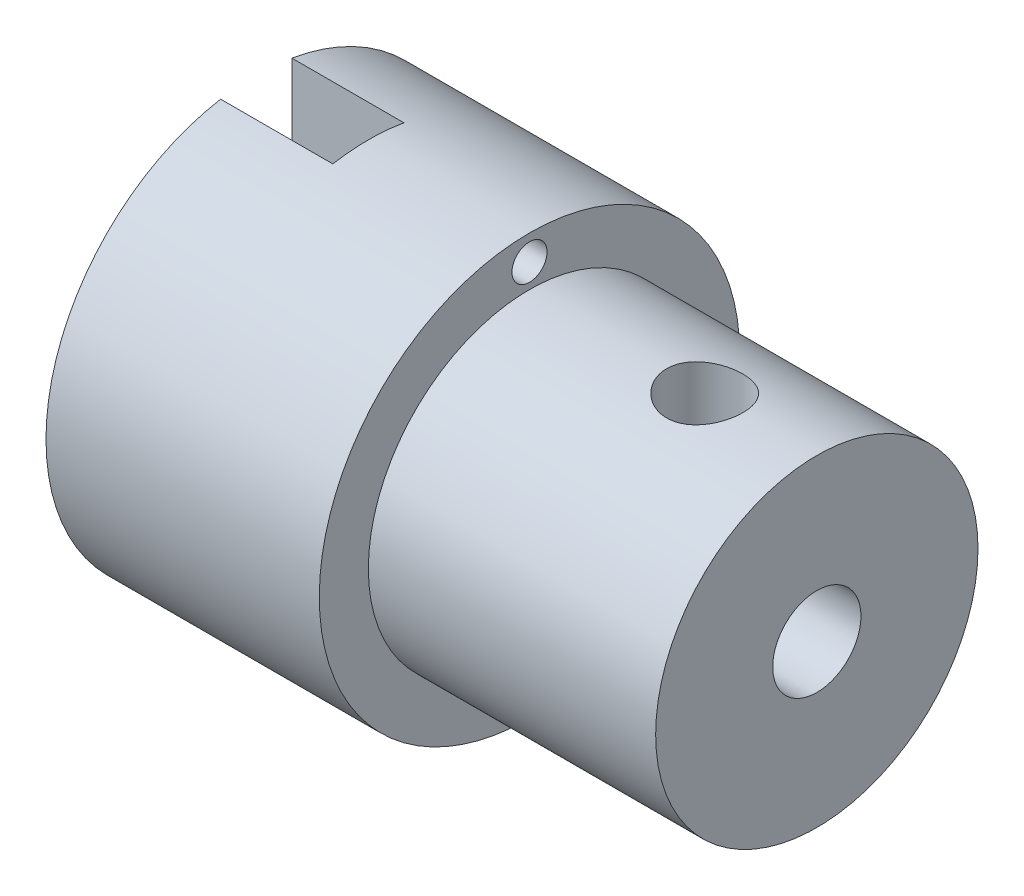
from build123d import *

# Parameters (mm, degrees)
SKETCH1_R                          = 9.525
SKETCH1_R_2                        = 1.5875
EXTRUDE1_DEPTH                     = 25.4
SKETCH5_R                          = 9.652
SKETCH5_R_2                        = 7.3025
CUT_EXTRUDE2_DEPTH                 = 13.0175
SKETCH6_W                          = 5.08
SKETCH6_H                          = 3.2258
CUT_EXTRUDE3_DEPTH                 = 10.16
SKETCH8_R                          = 0.79375
CUT_EXTRUDE4_DEPTH                 = 6.35
F_5_16_0_3125_DIAMETER_HOLE1_D     = 7.9375
F_5_16_0_3125_DIAMETER_HOLE1_DEPTH = 8.0772
F_5_16_0_3125_DIAMETER_HOLE1_TIP   = 2.384665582
SKETCH10_W                         = 1.7272
SKETCH10_H                         = 7.3025
SKETCH12_R                         = 2.00025
EXTRUDE2_DEPTH                     = 10.16


with BuildPart() as part:
    # Sketch1 → Extrude1 (new body)
    with BuildSketch(Plane(origin=(0, 0, 0), x_dir=(0, 0, -1), z_dir=(1, 0, 0))):
        Circle(SKETCH1_R)
        Circle(SKETCH1_R_2, mode=Mode.SUBTRACT)
    extrude(amount=EXTRUDE1_DEPTH)

    # Sketch5 → Cut-Extrude2 (cut)
    with BuildSketch(Plane(origin=(25.4, 0, 0), x_dir=(0, 0, -1), z_dir=(1, 0, 0))):
        Circle(SKETCH5_R)
        Circle(SKETCH5_R_2, mode=Mode.SUBTRACT)
    extrude(amount=-CUT_EXTRUDE2_DEPTH, mode=Mode.SUBTRACT)

    # Sketch6 → Cut-Extrude3 (cut, symmetric)
    with BuildSketch(Plane(origin=(0, 0, 0), x_dir=(1, 0, 0), z_dir=(0, 1, 0))):
        with Locations((2.54, 0)):
            Rectangle(SKETCH6_W, SKETCH6_H)
    extrude(amount=CUT_EXTRUDE3_DEPTH, both=True, mode=Mode.SUBTRACT)

    # Sketch8 → Cut-Extrude4 (cut)
    with BuildSketch(Plane(origin=(12.3825, 0, 0), x_dir=(0, 0, -1), z_dir=(1, 0, 0))):
        with Locations((0, 8.382)):
            Circle(SKETCH8_R)
    extrude(amount=-CUT_EXTRUDE4_DEPTH, mode=Mode.SUBTRACT)

    # 5_16 _0.3125_ Diameter Hole1
    with Locations(Plane(origin=(0, 0, 0), x_dir=(0, 0, -1), z_dir=(-1, 0, 0))):
        with Locations((0, 0)):
            Hole(F_5_16_0_3125_DIAMETER_HOLE1_D / 2, depth=F_5_16_0_3125_DIAMETER_HOLE1_DEPTH)
            with Locations((0, 0, -(F_5_16_0_3125_DIAMETER_HOLE1_DEPTH + F_5_16_0_3125_DIAMETER_HOLE1_TIP / 2))):  # 118° drill point
                Cone(0, F_5_16_0_3125_DIAMETER_HOLE1_D / 2, F_5_16_0_3125_DIAMETER_HOLE1_TIP, mode=Mode.SUBTRACT)

    # Sketch10 → 8-32 Tapped Hole1 (revolve, cut)
    with BuildSketch(Plane(origin=(20.32, 0, 0), x_dir=(0, 0, -1), z_dir=(1, 0, 0))):
        with Locations((0.8636, 3.65125)):
            Rectangle(SKETCH10_W, SKETCH10_H)
    revolve(axis=Axis((20.32, -6.35, 0), (0, 1, 0)), mode=Mode.SUBTRACT)

    # Sketch12 → Extrude2 (cut)
    with BuildSketch(Plane(origin=(25.4, 0, 0), x_dir=(0, 0, -1), z_dir=(1, 0, 0))):
        Circle(SKETCH12_R)
    extrude(amount=-EXTRUDE2_DEPTH, mode=Mode.SUBTRACT)


solid = part.part
